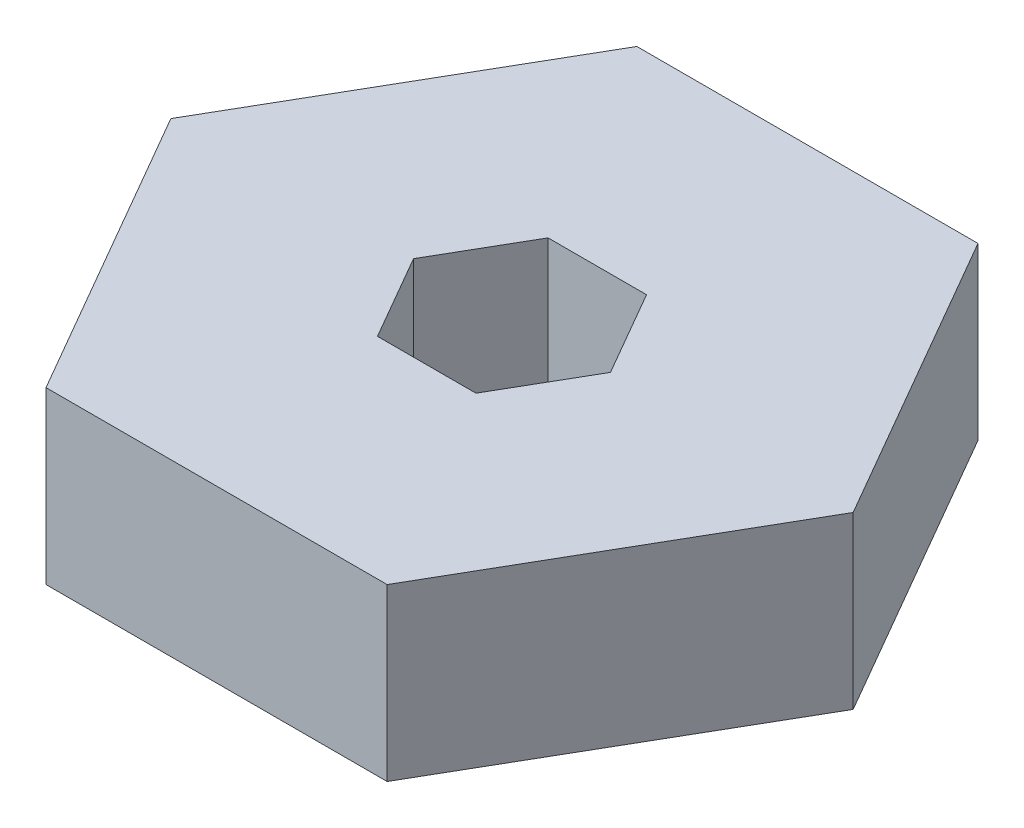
from build123d import *

# Parameters (mm, degrees)
BOSS_EXTRUDE1_DEPTH = 20


with BuildPart() as part:
    # Sketch2 → Boss-Extrude1 (new body)
    with BuildSketch(Plane(origin=(0, 0, 0), x_dir=(1, 0, 0), z_dir=(0, 1, 0))):
        Polygon((40, 0), (20, 34.641016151), (-20, 34.641016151), (-40, 0), (-20, -34.641016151), (20, -34.641016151), align=None)
        Polygon((11.547005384, 0), (5.773502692, 10), (-5.773502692, 10), (-11.547005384, 0), (-5.773502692, -10), (5.773502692, -10), align=None, mode=Mode.SUBTRACT)
    extrude(amount=BOSS_EXTRUDE1_DEPTH)


solid = part.part
